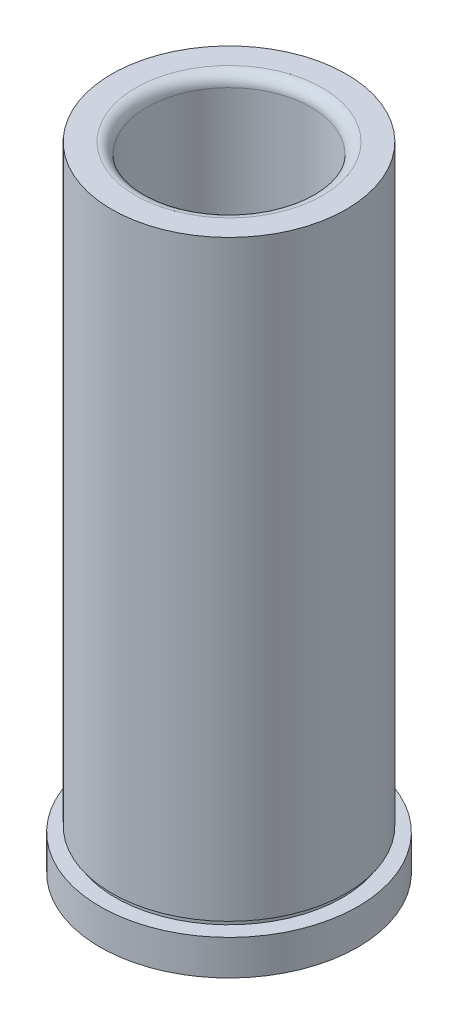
from build123d import *

# Parameters (mm, degrees)
FILLET1_R = 1.524


with BuildPart() as part:
    # Sketch1 → Revolve1 (revolve)
    with BuildSketch(Plane.XY, mode=Mode.PRIVATE) as revolve1_sk:
        with BuildLine():
            Line((-11.11885, 85.725), (-11.11885, 41.275))
            ThreePointArc((-11.11885, 41.275), (-12.016875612, 40.903025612), (-12.38885, 40.005))
            Line((-12.38885, 40.005), (-12.38885, 0.79375))
            Line((-12.38885, 0.79375), (-13.1826, 0))
            Line((-13.1826, 0), (-17.4625, 0))
            Line((-17.4625, 0), (-17.4625, 4.7625))
            Line((-17.4625, 4.7625), (-15.37335, 4.7625))
            Line((-15.37335, 4.7625), (-15.37335, 5.5245))
            Line((-15.37335, 5.5245), (-15.88135, 5.5245))
            Line((-15.88135, 5.5245), (-15.88135, 85.725))
            Line((-15.88135, 85.725), (-11.11885, 85.725))
        make_face()
    revolve(revolve1_sk.sketch.rotate(Axis((0, -1000, 0), (0, 1, 0)), 180), axis=Axis((0, -1000, 0), (0, 1, 0)))

    # Fillet1
    fillet1_edges = [part.edges().sort_by_distance(p)[0] for p in [
        (-11.11885, 85.725, 0),
    ]]
    fillet(fillet1_edges, radius=FILLET1_R)


solid = part.part
